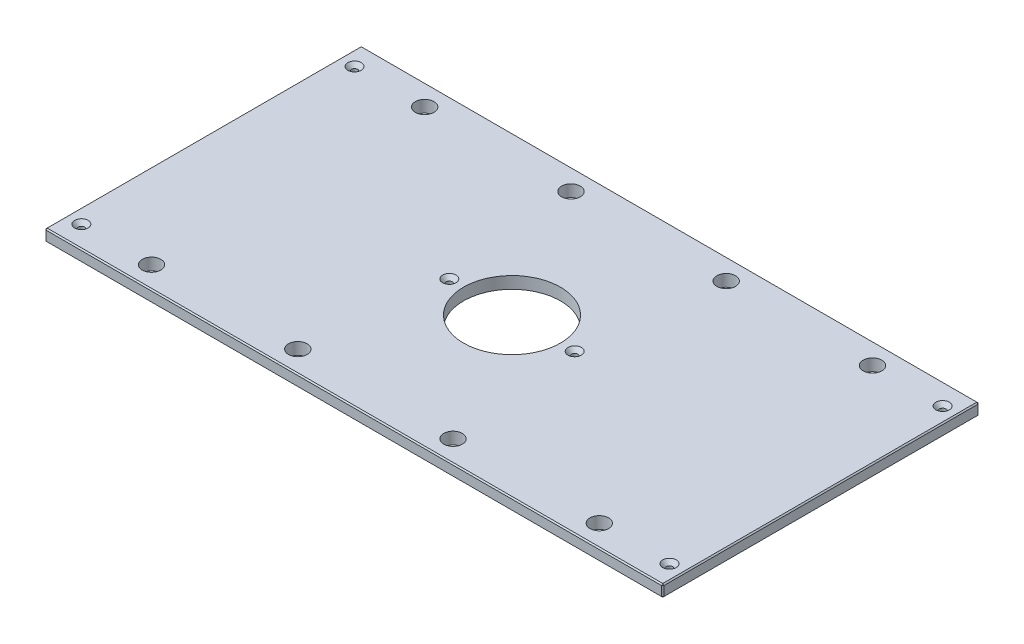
ISO-10303-21;
HEADER;
FILE_DESCRIPTION(('STEP AP214'),'2;1');
FILE_NAME('part.step','',(''),(''),'','','');
FILE_SCHEMA(('AUTOMOTIVE_DESIGN { 1 0 10303 214 1 1 1 1 }'));
ENDSEC;
DATA;
#1=APPLICATION_CONTEXT('core data for automotive mechanical design processes');
#2=APPLICATION_PROTOCOL_DEFINITION('international standard','automotive_design',2000,#1);
#3=PRODUCT_CONTEXT('',#1,'mechanical');
#4=PRODUCT('Part','Part','',(#3));
#5=PRODUCT_RELATED_PRODUCT_CATEGORY('part','',(#4));
#6=PRODUCT_DEFINITION_FORMATION('','',#4);
#7=PRODUCT_DEFINITION_CONTEXT('part definition',#1,'design');
#8=PRODUCT_DEFINITION('design','',#6,#7);
#9=PRODUCT_DEFINITION_SHAPE('','',#8);
#10=(LENGTH_UNIT() NAMED_UNIT(*) SI_UNIT(.MILLI.,.METRE.));
#11=(NAMED_UNIT(*) PLANE_ANGLE_UNIT() SI_UNIT($,.RADIAN.));
#12=(NAMED_UNIT(*) SI_UNIT($,.STERADIAN.) SOLID_ANGLE_UNIT());
#13=UNCERTAINTY_MEASURE_WITH_UNIT(LENGTH_MEASURE(1.E-05),#10,'distance_accuracy_value','');
#14=(GEOMETRIC_REPRESENTATION_CONTEXT(3) GLOBAL_UNCERTAINTY_ASSIGNED_CONTEXT((#13)) GLOBAL_UNIT_ASSIGNED_CONTEXT((#10,
#11,#12)) REPRESENTATION_CONTEXT('',''));
#15=CARTESIAN_POINT('',(0.,0.,0.));
#16=DIRECTION('',(0.,0.,1.));
#17=DIRECTION('',(1.,0.,0.));
#18=AXIS2_PLACEMENT_3D('',#15,#16,#17);
#19=CARTESIAN_POINT('',(-328.6125,12.7,-168.275));
#20=DIRECTION('',(1.,0.,0.));
#21=DIRECTION('',(0.,0.,-1.));
#22=AXIS2_PLACEMENT_3D('',#19,#20,#21);
#23=PLANE('',#22);
#24=DIRECTION('',(0.,0.,-1.));
#25=VECTOR('',#24,1.);
#26=CARTESIAN_POINT('',(-328.6125,11.43,-168.275));
#27=LINE('',#26,#25);
#28=CARTESIAN_POINT('',(-328.6125,11.43,167.005));
#29=VERTEX_POINT('',#28);
#30=CARTESIAN_POINT('',(-328.6125,11.43,-167.005));
#31=VERTEX_POINT('',#30);
#32=EDGE_CURVE('E135',#29,#31,#27,.T.);
#33=ORIENTED_EDGE('',*,*,#32,.T.);
#34=DIRECTION('',(0.,-1.,0.));
#35=VECTOR('',#34,1.);
#36=CARTESIAN_POINT('',(-328.6125,12.7,-167.005));
#37=LINE('',#36,#35);
#38=CARTESIAN_POINT('',(-328.6125,1.26999999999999,-167.005));
#39=VERTEX_POINT('',#38);
#40=EDGE_CURVE('E131',#31,#39,#37,.T.);
#41=ORIENTED_EDGE('',*,*,#40,.T.);
#42=DIRECTION('',(0.,0.,1.));
#43=VECTOR('',#42,1.);
#44=CARTESIAN_POINT('',(-328.6125,1.26999999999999,-168.275));
#45=LINE('',#44,#43);
#46=CARTESIAN_POINT('',(-328.6125,1.26999999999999,167.005));
#47=VERTEX_POINT('',#46);
#48=EDGE_CURVE('E126',#39,#47,#45,.T.);
#49=ORIENTED_EDGE('',*,*,#48,.T.);
#50=DIRECTION('',(0.,1.,0.));
#51=VECTOR('',#50,1.);
#52=CARTESIAN_POINT('',(-328.6125,12.7,167.005));
#53=LINE('',#52,#51);
#54=EDGE_CURVE('E128',#47,#29,#53,.T.);
#55=ORIENTED_EDGE('',*,*,#54,.T.);
#56=EDGE_LOOP('',(#33,#41,#49,#55));
#57=FACE_BOUND('',#56,.T.);
#58=ADVANCED_FACE('F35',(#57),#23,.F.);
#59=CARTESIAN_POINT('',(-328.6125,12.7,168.275));
#60=DIRECTION('',(0.,0.,-1.));
#61=DIRECTION('',(-1.,0.,0.));
#62=AXIS2_PLACEMENT_3D('',#59,#60,#61);
#63=PLANE('',#62);
#64=DIRECTION('',(1.,0.,0.));
#65=VECTOR('',#64,1.);
#66=CARTESIAN_POINT('',(-328.6125,1.26999999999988,168.275));
#67=LINE('',#66,#65);
#68=CARTESIAN_POINT('',(-327.3425,1.26999999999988,168.275));
#69=VERTEX_POINT('',#68);
#70=CARTESIAN_POINT('',(327.3425,1.26999999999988,168.275));
#71=VERTEX_POINT('',#70);
#72=EDGE_CURVE('E58',#69,#71,#67,.T.);
#73=ORIENTED_EDGE('',*,*,#72,.T.);
#74=DIRECTION('',(0.,1.,0.));
#75=VECTOR('',#74,1.);
#76=CARTESIAN_POINT('',(327.3425,12.7,168.275));
#77=LINE('',#76,#75);
#78=CARTESIAN_POINT('',(327.3425,11.4300000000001,168.275));
#79=VERTEX_POINT('',#78);
#80=EDGE_CURVE('E11',#71,#79,#77,.T.);
#81=ORIENTED_EDGE('',*,*,#80,.T.);
#82=DIRECTION('',(-1.,0.,0.));
#83=VECTOR('',#82,1.);
#84=CARTESIAN_POINT('',(-328.6125,11.4300000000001,168.275));
#85=LINE('',#84,#83);
#86=CARTESIAN_POINT('',(-327.3425,11.4300000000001,168.275));
#87=VERTEX_POINT('',#86);
#88=EDGE_CURVE('E44',#79,#87,#85,.T.);
#89=ORIENTED_EDGE('',*,*,#88,.T.);
#90=DIRECTION('',(0.,-1.,0.));
#91=VECTOR('',#90,1.);
#92=CARTESIAN_POINT('',(-327.3425,12.7,168.275));
#93=LINE('',#92,#91);
#94=EDGE_CURVE('E303',#87,#69,#93,.T.);
#95=ORIENTED_EDGE('',*,*,#94,.T.);
#96=EDGE_LOOP('',(#73,#81,#89,#95));
#97=FACE_BOUND('',#96,.T.);
#98=ADVANCED_FACE('F372',(#97),#63,.F.);
#99=CARTESIAN_POINT('',(328.6125,12.7,-168.275));
#100=DIRECTION('',(-1.,0.,0.));
#101=DIRECTION('',(0.,0.,1.));
#102=AXIS2_PLACEMENT_3D('',#99,#100,#101);
#103=PLANE('',#102);
#104=DIRECTION('',(0.,0.,-1.));
#105=VECTOR('',#104,1.);
#106=CARTESIAN_POINT('',(328.6125,1.26999999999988,-168.275));
#107=LINE('',#106,#105);
#108=CARTESIAN_POINT('',(328.6125,1.26999999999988,167.005));
#109=VERTEX_POINT('',#108);
#110=CARTESIAN_POINT('',(328.6125,1.26999999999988,-167.005));
#111=VERTEX_POINT('',#110);
#112=EDGE_CURVE('E298',#109,#111,#107,.T.);
#113=ORIENTED_EDGE('',*,*,#112,.T.);
#114=DIRECTION('',(0.,1.,0.));
#115=VECTOR('',#114,1.);
#116=CARTESIAN_POINT('',(328.6125,12.7,-167.005));
#117=LINE('',#116,#115);
#118=CARTESIAN_POINT('',(328.6125,11.43,-167.005));
#119=VERTEX_POINT('',#118);
#120=EDGE_CURVE('E300',#111,#119,#117,.T.);
#121=ORIENTED_EDGE('',*,*,#120,.T.);
#122=DIRECTION('',(0.,0.,1.));
#123=VECTOR('',#122,1.);
#124=CARTESIAN_POINT('',(328.6125,11.43,168.275));
#125=LINE('',#124,#123);
#126=CARTESIAN_POINT('',(328.6125,11.43,167.005));
#127=VERTEX_POINT('',#126);
#128=EDGE_CURVE('E296',#119,#127,#125,.T.);
#129=ORIENTED_EDGE('',*,*,#128,.T.);
#130=DIRECTION('',(0.,-1.,0.));
#131=VECTOR('',#130,1.);
#132=CARTESIAN_POINT('',(328.6125,12.7,167.005));
#133=LINE('',#132,#131);
#134=EDGE_CURVE('E294',#127,#109,#133,.T.);
#135=ORIENTED_EDGE('',*,*,#134,.T.);
#136=EDGE_LOOP('',(#113,#121,#129,#135));
#137=FACE_BOUND('',#136,.T.);
#138=ADVANCED_FACE('F359',(#137),#103,.F.);
#139=CARTESIAN_POINT('',(-328.6125,12.7,-168.275));
#140=DIRECTION('',(0.,0.,1.));
#141=DIRECTION('',(1.,0.,0.));
#142=AXIS2_PLACEMENT_3D('',#139,#140,#141);
#143=PLANE('',#142);
#144=DIRECTION('',(-1.,0.,0.));
#145=VECTOR('',#144,1.);
#146=CARTESIAN_POINT('',(-328.6125,1.26999999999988,-168.275));
#147=LINE('',#146,#145);
#148=CARTESIAN_POINT('',(327.3425,1.26999999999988,-168.275));
#149=VERTEX_POINT('',#148);
#150=CARTESIAN_POINT('',(-327.3425,1.26999999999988,-168.275));
#151=VERTEX_POINT('',#150);
#152=EDGE_CURVE('E270',#149,#151,#147,.T.);
#153=ORIENTED_EDGE('',*,*,#152,.T.);
#154=DIRECTION('',(0.,1.,0.));
#155=VECTOR('',#154,1.);
#156=CARTESIAN_POINT('',(-327.3425,12.7,-168.275));
#157=LINE('',#156,#155);
#158=CARTESIAN_POINT('',(-327.3425,11.43,-168.275));
#159=VERTEX_POINT('',#158);
#160=EDGE_CURVE('E274',#151,#159,#157,.T.);
#161=ORIENTED_EDGE('',*,*,#160,.T.);
#162=DIRECTION('',(1.,0.,0.));
#163=VECTOR('',#162,1.);
#164=CARTESIAN_POINT('',(328.6125,11.43,-168.275));
#165=LINE('',#164,#163);
#166=CARTESIAN_POINT('',(327.3425,11.43,-168.275));
#167=VERTEX_POINT('',#166);
#168=EDGE_CURVE('E272',#159,#167,#165,.T.);
#169=ORIENTED_EDGE('',*,*,#168,.T.);
#170=DIRECTION('',(0.,-1.,0.));
#171=VECTOR('',#170,1.);
#172=CARTESIAN_POINT('',(327.3425,12.7,-168.275));
#173=LINE('',#172,#171);
#174=EDGE_CURVE('E268',#167,#149,#173,.T.);
#175=ORIENTED_EDGE('',*,*,#174,.T.);
#176=EDGE_LOOP('',(#153,#161,#169,#175));
#177=FACE_BOUND('',#176,.T.);
#178=ADVANCED_FACE('F333',(#177),#143,.F.);
#179=CARTESIAN_POINT('',(0.,12.7,0.));
#180=DIRECTION('',(0.,1.,0.));
#181=DIRECTION('',(0.,0.,1.));
#182=AXIS2_PLACEMENT_3D('',#179,#180,#181);
#183=PLANE('',#182);
#184=CARTESIAN_POINT('',(312.7375,12.7,-145.25498));
#185=DIRECTION('',(0.,1.,0.));
#186=DIRECTION('',(0.,0.,1.));
#187=AXIS2_PLACEMENT_3D('',#184,#185,#186);
#188=CIRCLE('',#187,7.13740000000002);
#189=CARTESIAN_POINT('',(312.7375,12.7,-138.11758));
#190=VERTEX_POINT('',#189);
#191=EDGE_CURVE('E816',#190,#190,#188,.T.);
#192=ORIENTED_EDGE('',*,*,#191,.F.);
#193=EDGE_LOOP('',(#192));
#194=FACE_BOUND('',#193,.T.);
#195=CARTESIAN_POINT('',(312.7375,12.7,145.25498));
#196=DIRECTION('',(0.,1.,0.));
#197=DIRECTION('',(0.,0.,1.));
#198=AXIS2_PLACEMENT_3D('',#195,#196,#197);
#199=CIRCLE('',#198,7.13740000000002);
#200=CARTESIAN_POINT('',(312.7375,12.7,152.39238));
#201=VERTEX_POINT('',#200);
#202=EDGE_CURVE('E820',#201,#201,#199,.T.);
#203=ORIENTED_EDGE('',*,*,#202,.F.);
#204=EDGE_LOOP('',(#203));
#205=FACE_BOUND('',#204,.T.);
#206=CARTESIAN_POINT('',(-312.7375,12.7,145.25498));
#207=DIRECTION('',(0.,1.,0.));
#208=DIRECTION('',(0.,0.,1.));
#209=AXIS2_PLACEMENT_3D('',#206,#207,#208);
#210=CIRCLE('',#209,7.13740000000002);
#211=CARTESIAN_POINT('',(-312.7375,12.7,152.39238));
#212=VERTEX_POINT('',#211);
#213=EDGE_CURVE('E824',#212,#212,#210,.T.);
#214=ORIENTED_EDGE('',*,*,#213,.F.);
#215=EDGE_LOOP('',(#214));
#216=FACE_BOUND('',#215,.T.);
#217=CARTESIAN_POINT('',(-66.675,12.7,0.));
#218=DIRECTION('',(0.,1.,0.));
#219=DIRECTION('',(0.,0.,1.));
#220=AXIS2_PLACEMENT_3D('',#217,#218,#219);
#221=CIRCLE('',#220,7.1374);
#222=CARTESIAN_POINT('',(-66.675,12.7,7.1374));
#223=VERTEX_POINT('',#222);
#224=EDGE_CURVE('E828',#223,#223,#221,.T.);
#225=ORIENTED_EDGE('',*,*,#224,.F.);
#226=EDGE_LOOP('',(#225));
#227=FACE_BOUND('',#226,.T.);
#228=CARTESIAN_POINT('',(66.675,12.7,0.));
#229=DIRECTION('',(0.,1.,0.));
#230=DIRECTION('',(0.,0.,1.));
#231=AXIS2_PLACEMENT_3D('',#228,#229,#230);
#232=CIRCLE('',#231,7.1374);
#233=CARTESIAN_POINT('',(66.675,12.7,7.1374));
#234=VERTEX_POINT('',#233);
#235=EDGE_CURVE('E832',#234,#234,#232,.T.);
#236=ORIENTED_EDGE('',*,*,#235,.F.);
#237=EDGE_LOOP('',(#236));
#238=FACE_BOUND('',#237,.T.);
#239=CARTESIAN_POINT('',(-312.7375,12.7,-145.25498));
#240=DIRECTION('',(0.,1.,0.));
#241=DIRECTION('',(0.,0.,1.));
#242=AXIS2_PLACEMENT_3D('',#239,#240,#241);
#243=CIRCLE('',#242,7.13740000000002);
#244=CARTESIAN_POINT('',(-312.7375,12.7,-138.11758));
#245=VERTEX_POINT('',#244);
#246=EDGE_CURVE('E835',#245,#245,#243,.T.);
#247=ORIENTED_EDGE('',*,*,#246,.F.);
#248=EDGE_LOOP('',(#247));
#249=FACE_BOUND('',#248,.T.);
#250=DIRECTION('',(0.,0.,-1.));
#251=VECTOR('',#250,1.);
#252=CARTESIAN_POINT('',(327.3425,12.7,-168.275));
#253=LINE('',#252,#251);
#254=CARTESIAN_POINT('',(327.3425,12.7,167.005));
#255=VERTEX_POINT('',#254);
#256=CARTESIAN_POINT('',(327.3425,12.7,-167.005));
#257=VERTEX_POINT('',#256);
#258=EDGE_CURVE('E281',#255,#257,#253,.T.);
#259=ORIENTED_EDGE('',*,*,#258,.T.);
#260=DIRECTION('',(-1.,0.,0.));
#261=VECTOR('',#260,1.);
#262=CARTESIAN_POINT('',(-328.6125,12.7,-167.005));
#263=LINE('',#262,#261);
#264=CARTESIAN_POINT('',(-327.3425,12.7,-167.005));
#265=VERTEX_POINT('',#264);
#266=EDGE_CURVE('E283',#257,#265,#263,.T.);
#267=ORIENTED_EDGE('',*,*,#266,.T.);
#268=DIRECTION('',(0.,0.,1.));
#269=VECTOR('',#268,1.);
#270=CARTESIAN_POINT('',(-327.3425,12.7,168.275));
#271=LINE('',#270,#269);
#272=CARTESIAN_POINT('',(-327.3425,12.7,167.005));
#273=VERTEX_POINT('',#272);
#274=EDGE_CURVE('E279',#265,#273,#271,.T.);
#275=ORIENTED_EDGE('',*,*,#274,.T.);
#276=DIRECTION('',(1.,0.,0.));
#277=VECTOR('',#276,1.);
#278=CARTESIAN_POINT('',(328.6125,12.7,167.005));
#279=LINE('',#278,#277);
#280=EDGE_CURVE('E277',#273,#255,#279,.T.);
#281=ORIENTED_EDGE('',*,*,#280,.T.);
#282=EDGE_LOOP('',(#259,#267,#275,#281));
#283=FACE_BOUND('',#282,.T.);
#284=CARTESIAN_POINT('',(238.125,12.7,-145.25498));
#285=DIRECTION('',(0.,1.,0.));
#286=DIRECTION('',(0.,0.,1.));
#287=AXIS2_PLACEMENT_3D('',#284,#285,#286);
#288=CIRCLE('',#287,9.921875);
#289=CARTESIAN_POINT('',(238.125,12.7,-135.333105));
#290=VERTEX_POINT('',#289);
#291=EDGE_CURVE('E204',#290,#290,#288,.T.);
#292=ORIENTED_EDGE('',*,*,#291,.F.);
#293=EDGE_LOOP('',(#292));
#294=FACE_BOUND('',#293,.T.);
#295=CARTESIAN_POINT('',(-238.125,12.7,-145.25498));
#296=DIRECTION('',(0.,1.,0.));
#297=DIRECTION('',(0.,0.,1.));
#298=AXIS2_PLACEMENT_3D('',#295,#296,#297);
#299=CIRCLE('',#298,9.921875);
#300=CARTESIAN_POINT('',(-238.125,12.7,-135.333105));
#301=VERTEX_POINT('',#300);
#302=EDGE_CURVE('E214',#301,#301,#299,.T.);
#303=ORIENTED_EDGE('',*,*,#302,.F.);
#304=EDGE_LOOP('',(#303));
#305=FACE_BOUND('',#304,.T.);
#306=CARTESIAN_POINT('',(238.125,12.7,145.25498));
#307=DIRECTION('',(0.,1.,0.));
#308=DIRECTION('',(0.,0.,1.));
#309=AXIS2_PLACEMENT_3D('',#306,#307,#308);
#310=CIRCLE('',#309,9.921875);
#311=CARTESIAN_POINT('',(238.125,12.7,155.176855));
#312=VERTEX_POINT('',#311);
#313=EDGE_CURVE('E225',#312,#312,#310,.T.);
#314=ORIENTED_EDGE('',*,*,#313,.F.);
#315=EDGE_LOOP('',(#314));
#316=FACE_BOUND('',#315,.T.);
#317=CARTESIAN_POINT('',(-238.125,12.7,145.25498));
#318=DIRECTION('',(0.,1.,0.));
#319=DIRECTION('',(0.,0.,1.));
#320=AXIS2_PLACEMENT_3D('',#317,#318,#319);
#321=CIRCLE('',#320,9.921875);
#322=CARTESIAN_POINT('',(-238.125,12.7,155.176855));
#323=VERTEX_POINT('',#322);
#324=EDGE_CURVE('E231',#323,#323,#321,.T.);
#325=ORIENTED_EDGE('',*,*,#324,.F.);
#326=EDGE_LOOP('',(#325));
#327=FACE_BOUND('',#326,.T.);
#328=CARTESIAN_POINT('',(-82.55,12.7,-145.25498));
#329=DIRECTION('',(0.,1.,0.));
#330=DIRECTION('',(0.,0.,1.));
#331=AXIS2_PLACEMENT_3D('',#328,#329,#330);
#332=CIRCLE('',#331,9.921875);
#333=CARTESIAN_POINT('',(-82.55,12.7,-135.333105));
#334=VERTEX_POINT('',#333);
#335=EDGE_CURVE('E237',#334,#334,#332,.T.);
#336=ORIENTED_EDGE('',*,*,#335,.F.);
#337=EDGE_LOOP('',(#336));
#338=FACE_BOUND('',#337,.T.);
#339=CARTESIAN_POINT('',(82.55,12.7,-145.25498));
#340=DIRECTION('',(0.,1.,0.));
#341=DIRECTION('',(0.,0.,1.));
#342=AXIS2_PLACEMENT_3D('',#339,#340,#341);
#343=CIRCLE('',#342,9.921875);
#344=CARTESIAN_POINT('',(82.55,12.7,-135.333105));
#345=VERTEX_POINT('',#344);
#346=EDGE_CURVE('E243',#345,#345,#343,.T.);
#347=ORIENTED_EDGE('',*,*,#346,.F.);
#348=EDGE_LOOP('',(#347));
#349=FACE_BOUND('',#348,.T.);
#350=CARTESIAN_POINT('',(82.55,12.7,145.25498));
#351=DIRECTION('',(0.,1.,0.));
#352=DIRECTION('',(0.,0.,1.));
#353=AXIS2_PLACEMENT_3D('',#350,#351,#352);
#354=CIRCLE('',#353,9.921875);
#355=CARTESIAN_POINT('',(82.55,12.7,155.176855));
#356=VERTEX_POINT('',#355);
#357=EDGE_CURVE('E249',#356,#356,#354,.T.);
#358=ORIENTED_EDGE('',*,*,#357,.F.);
#359=EDGE_LOOP('',(#358));
#360=FACE_BOUND('',#359,.T.);
#361=CARTESIAN_POINT('',(-82.55,12.7,145.25498));
#362=DIRECTION('',(0.,1.,0.));
#363=DIRECTION('',(0.,0.,1.));
#364=AXIS2_PLACEMENT_3D('',#361,#362,#363);
#365=CIRCLE('',#364,9.921875);
#366=CARTESIAN_POINT('',(-82.55,12.7,155.176855));
#367=VERTEX_POINT('',#366);
#368=EDGE_CURVE('E255',#367,#367,#365,.T.);
#369=ORIENTED_EDGE('',*,*,#368,.F.);
#370=EDGE_LOOP('',(#369));
#371=FACE_BOUND('',#370,.T.);
#372=CARTESIAN_POINT('',(0.,12.7,0.));
#373=DIRECTION('',(0.,1.,0.));
#374=DIRECTION('',(0.,0.,1.));
#375=AXIS2_PLACEMENT_3D('',#372,#373,#374);
#376=CIRCLE('',#375,51.562);
#377=CARTESIAN_POINT('',(0.,12.7,51.562));
#378=VERTEX_POINT('',#377);
#379=EDGE_CURVE('E261',#378,#378,#376,.T.);
#380=ORIENTED_EDGE('',*,*,#379,.F.);
#381=EDGE_LOOP('',(#380));
#382=FACE_BOUND('',#381,.T.);
#383=ADVANCED_FACE('F381',(#194,#205,#216,#227,#238,#249,#283,#294,#305,#316,#327,#338,#349,
#360,#371,#382),#183,.T.);
#384=CARTESIAN_POINT('',(0.,0.,0.));
#385=DIRECTION('',(0.,1.,0.));
#386=DIRECTION('',(0.,0.,1.));
#387=AXIS2_PLACEMENT_3D('',#384,#385,#386);
#388=PLANE('',#387);
#389=CARTESIAN_POINT('',(312.7375,0.,-145.25498));
#390=DIRECTION('',(0.,1.,0.));
#391=DIRECTION('',(0.,0.,1.));
#392=AXIS2_PLACEMENT_3D('',#389,#390,#391);
#393=CIRCLE('',#392,3.3782);
#394=CARTESIAN_POINT('',(312.7375,0.,-141.87678));
#395=VERTEX_POINT('',#394);
#396=EDGE_CURVE('E869',#395,#395,#393,.T.);
#397=ORIENTED_EDGE('',*,*,#396,.T.);
#398=EDGE_LOOP('',(#397));
#399=FACE_BOUND('',#398,.T.);
#400=CARTESIAN_POINT('',(312.7375,0.,145.25498));
#401=DIRECTION('',(0.,1.,0.));
#402=DIRECTION('',(0.,0.,1.));
#403=AXIS2_PLACEMENT_3D('',#400,#401,#402);
#404=CIRCLE('',#403,3.3782);
#405=CARTESIAN_POINT('',(312.7375,0.,148.63318));
#406=VERTEX_POINT('',#405);
#407=EDGE_CURVE('E862',#406,#406,#404,.T.);
#408=ORIENTED_EDGE('',*,*,#407,.T.);
#409=EDGE_LOOP('',(#408));
#410=FACE_BOUND('',#409,.T.);
#411=CARTESIAN_POINT('',(-312.7375,0.,145.25498));
#412=DIRECTION('',(0.,1.,0.));
#413=DIRECTION('',(0.,0.,1.));
#414=AXIS2_PLACEMENT_3D('',#411,#412,#413);
#415=CIRCLE('',#414,3.3782);
#416=CARTESIAN_POINT('',(-312.7375,0.,148.63318));
#417=VERTEX_POINT('',#416);
#418=EDGE_CURVE('E855',#417,#417,#415,.T.);
#419=ORIENTED_EDGE('',*,*,#418,.T.);
#420=EDGE_LOOP('',(#419));
#421=FACE_BOUND('',#420,.T.);
#422=CARTESIAN_POINT('',(-66.675,0.,0.));
#423=DIRECTION('',(0.,1.,0.));
#424=DIRECTION('',(0.,0.,1.));
#425=AXIS2_PLACEMENT_3D('',#422,#423,#424);
#426=CIRCLE('',#425,3.3782);
#427=CARTESIAN_POINT('',(-66.675,0.,3.3782));
#428=VERTEX_POINT('',#427);
#429=EDGE_CURVE('E848',#428,#428,#426,.T.);
#430=ORIENTED_EDGE('',*,*,#429,.T.);
#431=EDGE_LOOP('',(#430));
#432=FACE_BOUND('',#431,.T.);
#433=CARTESIAN_POINT('',(66.675,0.,0.));
#434=DIRECTION('',(0.,1.,0.));
#435=DIRECTION('',(0.,0.,1.));
#436=AXIS2_PLACEMENT_3D('',#433,#434,#435);
#437=CIRCLE('',#436,3.3782);
#438=CARTESIAN_POINT('',(66.675,0.,3.3782));
#439=VERTEX_POINT('',#438);
#440=EDGE_CURVE('E838',#439,#439,#437,.T.);
#441=ORIENTED_EDGE('',*,*,#440,.T.);
#442=EDGE_LOOP('',(#441));
#443=FACE_BOUND('',#442,.T.);
#444=CARTESIAN_POINT('',(-312.7375,0.,-145.25498));
#445=DIRECTION('',(0.,1.,0.));
#446=DIRECTION('',(0.,0.,1.));
#447=AXIS2_PLACEMENT_3D('',#444,#445,#446);
#448=CIRCLE('',#447,3.3782);
#449=CARTESIAN_POINT('',(-312.7375,0.,-141.87678));
#450=VERTEX_POINT('',#449);
#451=EDGE_CURVE('E217',#450,#450,#448,.T.);
#452=ORIENTED_EDGE('',*,*,#451,.T.);
#453=EDGE_LOOP('',(#452));
#454=FACE_BOUND('',#453,.T.);
#455=DIRECTION('',(0.,0.,-1.));
#456=VECTOR('',#455,1.);
#457=CARTESIAN_POINT('',(-327.3425,0.,0.));
#458=LINE('',#457,#456);
#459=CARTESIAN_POINT('',(-327.3425,0.,167.005));
#460=VERTEX_POINT('',#459);
#461=CARTESIAN_POINT('',(-327.3425,0.,-167.005));
#462=VERTEX_POINT('',#461);
#463=EDGE_CURVE('E158',#460,#462,#458,.T.);
#464=ORIENTED_EDGE('',*,*,#463,.T.);
#465=DIRECTION('',(1.,0.,0.));
#466=VECTOR('',#465,1.);
#467=CARTESIAN_POINT('',(0.,0.,-167.005));
#468=LINE('',#467,#466);
#469=CARTESIAN_POINT('',(327.3425,0.,-167.005));
#470=VERTEX_POINT('',#469);
#471=EDGE_CURVE('E291',#462,#470,#468,.T.);
#472=ORIENTED_EDGE('',*,*,#471,.T.);
#473=DIRECTION('',(0.,0.,1.));
#474=VECTOR('',#473,1.);
#475=CARTESIAN_POINT('',(327.3425,0.,0.));
#476=LINE('',#475,#474);
#477=CARTESIAN_POINT('',(327.3425,0.,167.005));
#478=VERTEX_POINT('',#477);
#479=EDGE_CURVE('E289',#470,#478,#476,.T.);
#480=ORIENTED_EDGE('',*,*,#479,.T.);
#481=DIRECTION('',(-1.,0.,0.));
#482=VECTOR('',#481,1.);
#483=CARTESIAN_POINT('',(0.,0.,167.005));
#484=LINE('',#483,#482);
#485=EDGE_CURVE('E286',#478,#460,#484,.T.);
#486=ORIENTED_EDGE('',*,*,#485,.T.);
#487=EDGE_LOOP('',(#464,#472,#480,#486));
#488=FACE_BOUND('',#487,.T.);
#489=CARTESIAN_POINT('',(238.125,0.,-145.25498));
#490=DIRECTION('',(0.,1.,0.));
#491=DIRECTION('',(0.,0.,1.));
#492=AXIS2_PLACEMENT_3D('',#489,#490,#491);
#493=CIRCLE('',#492,9.921875);
#494=CARTESIAN_POINT('',(238.125,0.,-135.333105));
#495=VERTEX_POINT('',#494);
#496=EDGE_CURVE('E209',#495,#495,#493,.T.);
#497=ORIENTED_EDGE('',*,*,#496,.T.);
#498=EDGE_LOOP('',(#497));
#499=FACE_BOUND('',#498,.T.);
#500=CARTESIAN_POINT('',(-238.125,0.,-145.25498));
#501=DIRECTION('',(0.,1.,0.));
#502=DIRECTION('',(0.,0.,1.));
#503=AXIS2_PLACEMENT_3D('',#500,#501,#502);
#504=CIRCLE('',#503,9.921875);
#505=CARTESIAN_POINT('',(-238.125,0.,-135.333105));
#506=VERTEX_POINT('',#505);
#507=EDGE_CURVE('E222',#506,#506,#504,.T.);
#508=ORIENTED_EDGE('',*,*,#507,.T.);
#509=EDGE_LOOP('',(#508));
#510=FACE_BOUND('',#509,.T.);
#511=CARTESIAN_POINT('',(238.125,0.,145.25498));
#512=DIRECTION('',(0.,1.,0.));
#513=DIRECTION('',(0.,0.,1.));
#514=AXIS2_PLACEMENT_3D('',#511,#512,#513);
#515=CIRCLE('',#514,9.921875);
#516=CARTESIAN_POINT('',(238.125,0.,155.176855));
#517=VERTEX_POINT('',#516);
#518=EDGE_CURVE('E228',#517,#517,#515,.T.);
#519=ORIENTED_EDGE('',*,*,#518,.T.);
#520=EDGE_LOOP('',(#519));
#521=FACE_BOUND('',#520,.T.);
#522=CARTESIAN_POINT('',(-238.125,0.,145.25498));
#523=DIRECTION('',(0.,1.,0.));
#524=DIRECTION('',(0.,0.,1.));
#525=AXIS2_PLACEMENT_3D('',#522,#523,#524);
#526=CIRCLE('',#525,9.921875);
#527=CARTESIAN_POINT('',(-238.125,0.,155.176855));
#528=VERTEX_POINT('',#527);
#529=EDGE_CURVE('E234',#528,#528,#526,.T.);
#530=ORIENTED_EDGE('',*,*,#529,.T.);
#531=EDGE_LOOP('',(#530));
#532=FACE_BOUND('',#531,.T.);
#533=CARTESIAN_POINT('',(-82.55,0.,-145.25498));
#534=DIRECTION('',(0.,1.,0.));
#535=DIRECTION('',(0.,0.,1.));
#536=AXIS2_PLACEMENT_3D('',#533,#534,#535);
#537=CIRCLE('',#536,9.921875);
#538=CARTESIAN_POINT('',(-82.55,0.,-135.333105));
#539=VERTEX_POINT('',#538);
#540=EDGE_CURVE('E240',#539,#539,#537,.T.);
#541=ORIENTED_EDGE('',*,*,#540,.T.);
#542=EDGE_LOOP('',(#541));
#543=FACE_BOUND('',#542,.T.);
#544=CARTESIAN_POINT('',(82.55,0.,-145.25498));
#545=DIRECTION('',(0.,1.,0.));
#546=DIRECTION('',(0.,0.,1.));
#547=AXIS2_PLACEMENT_3D('',#544,#545,#546);
#548=CIRCLE('',#547,9.921875);
#549=CARTESIAN_POINT('',(82.55,0.,-135.333105));
#550=VERTEX_POINT('',#549);
#551=EDGE_CURVE('E246',#550,#550,#548,.T.);
#552=ORIENTED_EDGE('',*,*,#551,.T.);
#553=EDGE_LOOP('',(#552));
#554=FACE_BOUND('',#553,.T.);
#555=CARTESIAN_POINT('',(82.55,0.,145.25498));
#556=DIRECTION('',(0.,1.,0.));
#557=DIRECTION('',(0.,0.,1.));
#558=AXIS2_PLACEMENT_3D('',#555,#556,#557);
#559=CIRCLE('',#558,9.921875);
#560=CARTESIAN_POINT('',(82.55,0.,155.176855));
#561=VERTEX_POINT('',#560);
#562=EDGE_CURVE('E252',#561,#561,#559,.T.);
#563=ORIENTED_EDGE('',*,*,#562,.T.);
#564=EDGE_LOOP('',(#563));
#565=FACE_BOUND('',#564,.T.);
#566=CARTESIAN_POINT('',(-82.55,0.,145.25498));
#567=DIRECTION('',(0.,1.,0.));
#568=DIRECTION('',(0.,0.,1.));
#569=AXIS2_PLACEMENT_3D('',#566,#567,#568);
#570=CIRCLE('',#569,9.921875);
#571=CARTESIAN_POINT('',(-82.55,0.,155.176855));
#572=VERTEX_POINT('',#571);
#573=EDGE_CURVE('E258',#572,#572,#570,.T.);
#574=ORIENTED_EDGE('',*,*,#573,.T.);
#575=EDGE_LOOP('',(#574));
#576=FACE_BOUND('',#575,.T.);
#577=CARTESIAN_POINT('',(0.,0.,0.));
#578=DIRECTION('',(0.,1.,0.));
#579=DIRECTION('',(0.,0.,1.));
#580=AXIS2_PLACEMENT_3D('',#577,#578,#579);
#581=CIRCLE('',#580,51.562);
#582=CARTESIAN_POINT('',(0.,0.,51.562));
#583=VERTEX_POINT('',#582);
#584=EDGE_CURVE('E147',#583,#583,#581,.T.);
#585=ORIENTED_EDGE('',*,*,#584,.T.);
#586=EDGE_LOOP('',(#585));
#587=FACE_BOUND('',#586,.T.);
#588=ADVANCED_FACE('F346',(#399,#410,#421,#432,#443,#454,#488,#499,#510,#521,#532,#543,#554,
#565,#576,#587),#388,.F.);
#589=CARTESIAN_POINT('',(0.,0.,0.));
#590=DIRECTION('',(0.,1.,0.));
#591=DIRECTION('',(0.,0.,1.));
#592=AXIS2_PLACEMENT_3D('',#589,#590,#591);
#593=CYLINDRICAL_SURFACE('',#592,51.562);
#594=ORIENTED_EDGE('',*,*,#584,.F.);
#595=EDGE_LOOP('',(#594));
#596=FACE_BOUND('',#595,.T.);
#597=ORIENTED_EDGE('',*,*,#379,.T.);
#598=EDGE_LOOP('',(#597));
#599=FACE_BOUND('',#598,.T.);
#600=ADVANCED_FACE('F751',(#596,#599),#593,.F.);
#601=CARTESIAN_POINT('',(-82.55,12.7,145.25498));
#602=DIRECTION('',(0.,1.,0.));
#603=DIRECTION('',(0.,0.,1.));
#604=AXIS2_PLACEMENT_3D('',#601,#602,#603);
#605=CYLINDRICAL_SURFACE('',#604,9.921875);
#606=ORIENTED_EDGE('',*,*,#573,.F.);
#607=EDGE_LOOP('',(#606));
#608=FACE_BOUND('',#607,.T.);
#609=ORIENTED_EDGE('',*,*,#368,.T.);
#610=EDGE_LOOP('',(#609));
#611=FACE_BOUND('',#610,.T.);
#612=ADVANCED_FACE('F742',(#608,#611),#605,.F.);
#613=CARTESIAN_POINT('',(82.55,12.7,145.25498));
#614=DIRECTION('',(0.,1.,0.));
#615=DIRECTION('',(0.,0.,1.));
#616=AXIS2_PLACEMENT_3D('',#613,#614,#615);
#617=CYLINDRICAL_SURFACE('',#616,9.921875);
#618=ORIENTED_EDGE('',*,*,#562,.F.);
#619=EDGE_LOOP('',(#618));
#620=FACE_BOUND('',#619,.T.);
#621=ORIENTED_EDGE('',*,*,#357,.T.);
#622=EDGE_LOOP('',(#621));
#623=FACE_BOUND('',#622,.T.);
#624=ADVANCED_FACE('F733',(#620,#623),#617,.F.);
#625=CARTESIAN_POINT('',(82.55,12.7,-145.25498));
#626=DIRECTION('',(0.,1.,0.));
#627=DIRECTION('',(0.,0.,1.));
#628=AXIS2_PLACEMENT_3D('',#625,#626,#627);
#629=CYLINDRICAL_SURFACE('',#628,9.921875);
#630=ORIENTED_EDGE('',*,*,#551,.F.);
#631=EDGE_LOOP('',(#630));
#632=FACE_BOUND('',#631,.T.);
#633=ORIENTED_EDGE('',*,*,#346,.T.);
#634=EDGE_LOOP('',(#633));
#635=FACE_BOUND('',#634,.T.);
#636=ADVANCED_FACE('F724',(#632,#635),#629,.F.);
#637=CARTESIAN_POINT('',(-82.55,12.7,-145.25498));
#638=DIRECTION('',(0.,1.,0.));
#639=DIRECTION('',(0.,0.,1.));
#640=AXIS2_PLACEMENT_3D('',#637,#638,#639);
#641=CYLINDRICAL_SURFACE('',#640,9.921875);
#642=ORIENTED_EDGE('',*,*,#540,.F.);
#643=EDGE_LOOP('',(#642));
#644=FACE_BOUND('',#643,.T.);
#645=ORIENTED_EDGE('',*,*,#335,.T.);
#646=EDGE_LOOP('',(#645));
#647=FACE_BOUND('',#646,.T.);
#648=ADVANCED_FACE('F715',(#644,#647),#641,.F.);
#649=CARTESIAN_POINT('',(-238.125,12.7,145.25498));
#650=DIRECTION('',(0.,1.,0.));
#651=DIRECTION('',(0.,0.,1.));
#652=AXIS2_PLACEMENT_3D('',#649,#650,#651);
#653=CYLINDRICAL_SURFACE('',#652,9.921875);
#654=ORIENTED_EDGE('',*,*,#529,.F.);
#655=EDGE_LOOP('',(#654));
#656=FACE_BOUND('',#655,.T.);
#657=ORIENTED_EDGE('',*,*,#324,.T.);
#658=EDGE_LOOP('',(#657));
#659=FACE_BOUND('',#658,.T.);
#660=ADVANCED_FACE('F706',(#656,#659),#653,.F.);
#661=CARTESIAN_POINT('',(238.125,12.7,145.25498));
#662=DIRECTION('',(0.,1.,0.));
#663=DIRECTION('',(0.,0.,1.));
#664=AXIS2_PLACEMENT_3D('',#661,#662,#663);
#665=CYLINDRICAL_SURFACE('',#664,9.921875);
#666=ORIENTED_EDGE('',*,*,#518,.F.);
#667=EDGE_LOOP('',(#666));
#668=FACE_BOUND('',#667,.T.);
#669=ORIENTED_EDGE('',*,*,#313,.T.);
#670=EDGE_LOOP('',(#669));
#671=FACE_BOUND('',#670,.T.);
#672=ADVANCED_FACE('F697',(#668,#671),#665,.F.);
#673=CARTESIAN_POINT('',(-238.125,12.7,-145.25498));
#674=DIRECTION('',(0.,1.,0.));
#675=DIRECTION('',(0.,0.,1.));
#676=AXIS2_PLACEMENT_3D('',#673,#674,#675);
#677=CYLINDRICAL_SURFACE('',#676,9.921875);
#678=ORIENTED_EDGE('',*,*,#507,.F.);
#679=EDGE_LOOP('',(#678));
#680=FACE_BOUND('',#679,.T.);
#681=ORIENTED_EDGE('',*,*,#302,.T.);
#682=EDGE_LOOP('',(#681));
#683=FACE_BOUND('',#682,.T.);
#684=ADVANCED_FACE('F687',(#680,#683),#677,.F.);
#685=CARTESIAN_POINT('',(238.125,12.7,-145.25498));
#686=DIRECTION('',(0.,1.,0.));
#687=DIRECTION('',(0.,0.,1.));
#688=AXIS2_PLACEMENT_3D('',#685,#686,#687);
#689=CYLINDRICAL_SURFACE('',#688,9.921875);
#690=ORIENTED_EDGE('',*,*,#496,.F.);
#691=EDGE_LOOP('',(#690));
#692=FACE_BOUND('',#691,.T.);
#693=ORIENTED_EDGE('',*,*,#291,.T.);
#694=EDGE_LOOP('',(#693));
#695=FACE_BOUND('',#694,.T.);
#696=ADVANCED_FACE('F390',(#692,#695),#689,.F.);
#697=CARTESIAN_POINT('',(328.6125,12.7,167.005));
#698=DIRECTION('',(-0.707106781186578,0.,-0.707106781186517));
#699=DIRECTION('',(0.,-1.,0.));
#700=AXIS2_PLACEMENT_3D('',#697,#698,#699);
#701=PLANE('',#700);
#702=DIRECTION('',(-0.707106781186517,0.,0.707106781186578));
#703=VECTOR('',#702,1.);
#704=CARTESIAN_POINT('',(328.6125,11.43,167.005));
#705=LINE('',#704,#703);
#706=EDGE_CURVE('E39',#79,#127,#705,.F.);
#707=ORIENTED_EDGE('',*,*,#706,.F.);
#708=ORIENTED_EDGE('',*,*,#80,.F.);
#709=DIRECTION('',(0.707106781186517,0.,-0.707106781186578));
#710=VECTOR('',#709,1.);
#711=CARTESIAN_POINT('',(327.9775,1.26999999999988,167.64));
#712=LINE('',#711,#710);
#713=EDGE_CURVE('E197',#109,#71,#712,.F.);
#714=ORIENTED_EDGE('',*,*,#713,.F.);
#715=ORIENTED_EDGE('',*,*,#134,.F.);
#716=EDGE_LOOP('',(#707,#708,#714,#715));
#717=FACE_BOUND('',#716,.T.);
#718=ADVANCED_FACE('F37',(#717),#701,.F.);
#719=CARTESIAN_POINT('',(328.6125,11.43,167.005));
#720=DIRECTION('',(0.577350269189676,0.577350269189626,0.577350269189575));
#721=DIRECTION('',(-0.707106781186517,0.707106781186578,0.));
#722=AXIS2_PLACEMENT_3D('',#719,#720,#721);
#723=PLANE('',#722);
#724=DIRECTION('',(0.,-0.707106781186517,0.707106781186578));
#725=VECTOR('',#724,1.);
#726=CARTESIAN_POINT('',(327.3425,12.0650000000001,167.64));
#727=LINE('',#726,#725);
#728=EDGE_CURVE('E193',#79,#255,#727,.F.);
#729=ORIENTED_EDGE('',*,*,#728,.F.);
#730=ORIENTED_EDGE('',*,*,#706,.T.);
#731=DIRECTION('',(-0.707106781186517,0.707106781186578,0.));
#732=VECTOR('',#731,1.);
#733=CARTESIAN_POINT('',(328.6125,11.43,167.005));
#734=LINE('',#733,#732);
#735=EDGE_CURVE('E195',#255,#127,#734,.F.);
#736=ORIENTED_EDGE('',*,*,#735,.F.);
#737=EDGE_LOOP('',(#729,#730,#736));
#738=FACE_BOUND('',#737,.T.);
#739=ADVANCED_FACE('F383',(#738),#723,.T.);
#740=CARTESIAN_POINT('',(327.3425,0.,167.005));
#741=DIRECTION('',(0.577350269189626,-0.577350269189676,0.577350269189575));
#742=DIRECTION('',(0.707106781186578,0.707106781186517,0.));
#743=AXIS2_PLACEMENT_3D('',#740,#741,#742);
#744=PLANE('',#743);
#745=DIRECTION('',(-0.707106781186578,-0.707106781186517,0.));
#746=VECTOR('',#745,1.);
#747=CARTESIAN_POINT('',(327.3425,0.,167.005));
#748=LINE('',#747,#746);
#749=EDGE_CURVE('E187',#109,#478,#748,.T.);
#750=ORIENTED_EDGE('',*,*,#749,.F.);
#751=ORIENTED_EDGE('',*,*,#713,.T.);
#752=DIRECTION('',(0.,0.707106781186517,0.707106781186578));
#753=VECTOR('',#752,1.);
#754=CARTESIAN_POINT('',(327.3425,0.,167.005));
#755=LINE('',#754,#753);
#756=EDGE_CURVE('E190',#478,#71,#755,.T.);
#757=ORIENTED_EDGE('',*,*,#756,.F.);
#758=EDGE_LOOP('',(#750,#751,#757));
#759=FACE_BOUND('',#758,.T.);
#760=ADVANCED_FACE('F352',(#759),#744,.T.);
#761=CARTESIAN_POINT('',(327.3425,12.7,0.));
#762=DIRECTION('',(0.707106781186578,0.707106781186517,0.));
#763=DIRECTION('',(0.,0.,1.));
#764=AXIS2_PLACEMENT_3D('',#761,#762,#763);
#765=PLANE('',#764);
#766=ORIENTED_EDGE('',*,*,#735,.T.);
#767=ORIENTED_EDGE('',*,*,#128,.F.);
#768=DIRECTION('',(0.707106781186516,-0.707106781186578,0.));
#769=VECTOR('',#768,1.);
#770=CARTESIAN_POINT('',(327.9775,12.065,-167.005));
#771=LINE('',#770,#769);
#772=EDGE_CURVE('E182',#257,#119,#771,.T.);
#773=ORIENTED_EDGE('',*,*,#772,.F.);
#774=ORIENTED_EDGE('',*,*,#258,.F.);
#775=EDGE_LOOP('',(#766,#767,#773,#774));
#776=FACE_BOUND('',#775,.T.);
#777=ADVANCED_FACE('F369',(#776),#765,.T.);
#778=CARTESIAN_POINT('',(0.,12.7,167.005));
#779=DIRECTION('',(0.,0.707106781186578,0.707106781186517));
#780=DIRECTION('',(-1.,0.,0.));
#781=AXIS2_PLACEMENT_3D('',#778,#779,#780);
#782=PLANE('',#781);
#783=ORIENTED_EDGE('',*,*,#728,.T.);
#784=ORIENTED_EDGE('',*,*,#280,.F.);
#785=DIRECTION('',(0.,0.707106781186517,-0.707106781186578));
#786=VECTOR('',#785,1.);
#787=CARTESIAN_POINT('',(-327.3425,12.7,167.005));
#788=LINE('',#787,#786);
#789=EDGE_CURVE('E179',#87,#273,#788,.T.);
#790=ORIENTED_EDGE('',*,*,#789,.F.);
#791=ORIENTED_EDGE('',*,*,#88,.F.);
#792=EDGE_LOOP('',(#783,#784,#790,#791));
#793=FACE_BOUND('',#792,.T.);
#794=ADVANCED_FACE('F374',(#793),#782,.T.);
#795=CARTESIAN_POINT('',(-327.3425,12.7,168.275));
#796=DIRECTION('',(0.707106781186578,0.,-0.707106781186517));
#797=DIRECTION('',(0.,-1.,0.));
#798=AXIS2_PLACEMENT_3D('',#795,#796,#797);
#799=PLANE('',#798);
#800=DIRECTION('',(0.707106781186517,0.,0.707106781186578));
#801=VECTOR('',#800,1.);
#802=CARTESIAN_POINT('',(-328.6125,1.26999999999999,167.005));
#803=LINE('',#802,#801);
#804=EDGE_CURVE('E142',#69,#47,#803,.F.);
#805=ORIENTED_EDGE('',*,*,#804,.F.);
#806=ORIENTED_EDGE('',*,*,#94,.F.);
#807=DIRECTION('',(-0.707106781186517,0.,-0.707106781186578));
#808=VECTOR('',#807,1.);
#809=CARTESIAN_POINT('',(-327.9775,11.4300000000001,167.64));
#810=LINE('',#809,#808);
#811=EDGE_CURVE('E145',#29,#87,#810,.F.);
#812=ORIENTED_EDGE('',*,*,#811,.F.);
#813=ORIENTED_EDGE('',*,*,#54,.F.);
#814=EDGE_LOOP('',(#805,#806,#812,#813));
#815=FACE_BOUND('',#814,.T.);
#816=ADVANCED_FACE('F140',(#815),#799,.F.);
#817=CARTESIAN_POINT('',(-328.6125,1.26999999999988,168.275));
#818=DIRECTION('',(0.,0.707106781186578,-0.707106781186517));
#819=DIRECTION('',(1.,0.,0.));
#820=AXIS2_PLACEMENT_3D('',#817,#818,#819);
#821=PLANE('',#820);
#822=ORIENTED_EDGE('',*,*,#756,.T.);
#823=ORIENTED_EDGE('',*,*,#72,.F.);
#824=DIRECTION('',(0.,-0.707106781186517,-0.707106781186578));
#825=VECTOR('',#824,1.);
#826=CARTESIAN_POINT('',(-327.3425,0.634999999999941,167.64));
#827=LINE('',#826,#825);
#828=EDGE_CURVE('E155',#460,#69,#827,.F.);
#829=ORIENTED_EDGE('',*,*,#828,.F.);
#830=ORIENTED_EDGE('',*,*,#485,.F.);
#831=EDGE_LOOP('',(#822,#823,#829,#830));
#832=FACE_BOUND('',#831,.T.);
#833=ADVANCED_FACE('F351',(#832),#821,.F.);
#834=CARTESIAN_POINT('',(328.6125,1.26999999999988,-168.275));
#835=DIRECTION('',(-0.707106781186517,0.707106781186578,0.));
#836=DIRECTION('',(0.,0.,-1.));
#837=AXIS2_PLACEMENT_3D('',#834,#835,#836);
#838=PLANE('',#837);
#839=ORIENTED_EDGE('',*,*,#749,.T.);
#840=ORIENTED_EDGE('',*,*,#479,.F.);
#841=DIRECTION('',(0.707106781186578,0.707106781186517,0.));
#842=VECTOR('',#841,1.);
#843=CARTESIAN_POINT('',(327.3425,0.,-167.005));
#844=LINE('',#843,#842);
#845=EDGE_CURVE('E174',#111,#470,#844,.F.);
#846=ORIENTED_EDGE('',*,*,#845,.F.);
#847=ORIENTED_EDGE('',*,*,#112,.F.);
#848=EDGE_LOOP('',(#839,#840,#846,#847));
#849=FACE_BOUND('',#848,.T.);
#850=ADVANCED_FACE('F356',(#849),#838,.F.);
#851=CARTESIAN_POINT('',(327.3425,12.7,-168.275));
#852=DIRECTION('',(-0.707106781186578,0.,0.707106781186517));
#853=DIRECTION('',(0.,-1.,0.));
#854=AXIS2_PLACEMENT_3D('',#851,#852,#853);
#855=PLANE('',#854);
#856=DIRECTION('',(0.707106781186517,0.,0.707106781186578));
#857=VECTOR('',#856,1.);
#858=CARTESIAN_POINT('',(327.3425,11.43,-168.275));
#859=LINE('',#858,#857);
#860=EDGE_CURVE('E184',#119,#167,#859,.F.);
#861=ORIENTED_EDGE('',*,*,#860,.F.);
#862=ORIENTED_EDGE('',*,*,#120,.F.);
#863=DIRECTION('',(-0.707106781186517,0.,-0.707106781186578));
#864=VECTOR('',#863,1.);
#865=CARTESIAN_POINT('',(327.9775,1.26999999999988,-167.64));
#866=LINE('',#865,#864);
#867=EDGE_CURVE('E171',#149,#111,#866,.F.);
#868=ORIENTED_EDGE('',*,*,#867,.F.);
#869=ORIENTED_EDGE('',*,*,#174,.F.);
#870=EDGE_LOOP('',(#861,#862,#868,#869));
#871=FACE_BOUND('',#870,.T.);
#872=ADVANCED_FACE('F364',(#871),#855,.F.);
#873=CARTESIAN_POINT('',(327.3425,11.43,-168.275));
#874=DIRECTION('',(0.577350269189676,0.577350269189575,-0.577350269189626));
#875=DIRECTION('',(-0.707106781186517,0.,-0.707106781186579));
#876=AXIS2_PLACEMENT_3D('',#873,#874,#875);
#877=PLANE('',#876);
#878=ORIENTED_EDGE('',*,*,#772,.T.);
#879=ORIENTED_EDGE('',*,*,#860,.T.);
#880=DIRECTION('',(0.,0.707106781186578,0.707106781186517));
#881=VECTOR('',#880,1.);
#882=CARTESIAN_POINT('',(327.3425,11.43,-168.275));
#883=LINE('',#882,#881);
#884=EDGE_CURVE('E163',#257,#167,#883,.F.);
#885=ORIENTED_EDGE('',*,*,#884,.F.);
#886=EDGE_LOOP('',(#878,#879,#885));
#887=FACE_BOUND('',#886,.T.);
#888=ADVANCED_FACE('F422',(#887),#877,.T.);
#889=CARTESIAN_POINT('',(-327.3425,12.7,167.005));
#890=DIRECTION('',(-0.577350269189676,0.577350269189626,0.577350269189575));
#891=DIRECTION('',(-0.707106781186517,-0.707106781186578,0.));
#892=AXIS2_PLACEMENT_3D('',#889,#890,#891);
#893=PLANE('',#892);
#894=ORIENTED_EDGE('',*,*,#811,.T.);
#895=ORIENTED_EDGE('',*,*,#789,.T.);
#896=DIRECTION('',(-0.707106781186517,-0.707106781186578,0.));
#897=VECTOR('',#896,1.);
#898=CARTESIAN_POINT('',(-327.3425,12.7,167.005));
#899=LINE('',#898,#897);
#900=EDGE_CURVE('E159',#29,#273,#899,.F.);
#901=ORIENTED_EDGE('',*,*,#900,.F.);
#902=EDGE_LOOP('',(#894,#895,#901));
#903=FACE_BOUND('',#902,.T.);
#904=ADVANCED_FACE('F376',(#903),#893,.T.);
#905=CARTESIAN_POINT('',(-328.6125,1.26999999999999,167.005));
#906=DIRECTION('',(-0.577350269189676,-0.577350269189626,0.577350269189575));
#907=DIRECTION('',(0.707106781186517,-0.707106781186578,0.));
#908=AXIS2_PLACEMENT_3D('',#905,#906,#907);
#909=PLANE('',#908);
#910=ORIENTED_EDGE('',*,*,#828,.T.);
#911=ORIENTED_EDGE('',*,*,#804,.T.);
#912=DIRECTION('',(-0.707106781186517,0.707106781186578,0.));
#913=VECTOR('',#912,1.);
#914=CARTESIAN_POINT('',(-328.6125,1.26999999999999,167.005));
#915=LINE('',#914,#913);
#916=EDGE_CURVE('E152',#460,#47,#915,.T.);
#917=ORIENTED_EDGE('',*,*,#916,.F.);
#918=EDGE_LOOP('',(#910,#911,#917));
#919=FACE_BOUND('',#918,.T.);
#920=ADVANCED_FACE('F151',(#919),#909,.T.);
#921=CARTESIAN_POINT('',(327.3425,0.,-167.005));
#922=DIRECTION('',(0.577350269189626,-0.577350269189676,-0.577350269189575));
#923=DIRECTION('',(0.707106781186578,0.707106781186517,0.));
#924=AXIS2_PLACEMENT_3D('',#921,#922,#923);
#925=PLANE('',#924);
#926=ORIENTED_EDGE('',*,*,#867,.T.);
#927=ORIENTED_EDGE('',*,*,#845,.T.);
#928=DIRECTION('',(0.,-0.707106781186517,0.707106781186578));
#929=VECTOR('',#928,1.);
#930=CARTESIAN_POINT('',(327.3425,0.,-167.005));
#931=LINE('',#930,#929);
#932=EDGE_CURVE('E160',#149,#470,#931,.T.);
#933=ORIENTED_EDGE('',*,*,#932,.F.);
#934=EDGE_LOOP('',(#926,#927,#933));
#935=FACE_BOUND('',#934,.T.);
#936=ADVANCED_FACE('F414',(#935),#925,.T.);
#937=CARTESIAN_POINT('',(0.,12.7,-167.005));
#938=DIRECTION('',(0.,0.707106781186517,-0.707106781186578));
#939=DIRECTION('',(1.,0.,0.));
#940=AXIS2_PLACEMENT_3D('',#937,#938,#939);
#941=PLANE('',#940);
#942=ORIENTED_EDGE('',*,*,#884,.T.);
#943=ORIENTED_EDGE('',*,*,#168,.F.);
#944=DIRECTION('',(0.,-0.707106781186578,-0.707106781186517));
#945=VECTOR('',#944,1.);
#946=CARTESIAN_POINT('',(-327.3425,11.43,-168.275));
#947=LINE('',#946,#945);
#948=EDGE_CURVE('E165',#265,#159,#947,.T.);
#949=ORIENTED_EDGE('',*,*,#948,.F.);
#950=ORIENTED_EDGE('',*,*,#266,.F.);
#951=EDGE_LOOP('',(#942,#943,#949,#950));
#952=FACE_BOUND('',#951,.T.);
#953=ADVANCED_FACE('F328',(#952),#941,.T.);
#954=CARTESIAN_POINT('',(-327.3425,12.7,0.));
#955=DIRECTION('',(-0.707106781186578,0.707106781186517,0.));
#956=DIRECTION('',(0.,0.,-1.));
#957=AXIS2_PLACEMENT_3D('',#954,#955,#956);
#958=PLANE('',#957);
#959=ORIENTED_EDGE('',*,*,#900,.T.);
#960=ORIENTED_EDGE('',*,*,#274,.F.);
#961=DIRECTION('',(0.707106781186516,0.707106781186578,0.));
#962=VECTOR('',#961,1.);
#963=CARTESIAN_POINT('',(-327.9775,12.065,-167.005));
#964=LINE('',#963,#962);
#965=EDGE_CURVE('E317',#31,#265,#964,.T.);
#966=ORIENTED_EDGE('',*,*,#965,.F.);
#967=ORIENTED_EDGE('',*,*,#32,.F.);
#968=EDGE_LOOP('',(#959,#960,#966,#967));
#969=FACE_BOUND('',#968,.T.);
#970=ADVANCED_FACE('F379',(#969),#958,.T.);
#971=CARTESIAN_POINT('',(-328.6125,1.26999999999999,-168.275));
#972=DIRECTION('',(0.707106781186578,0.707106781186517,0.));
#973=DIRECTION('',(0.,0.,1.));
#974=AXIS2_PLACEMENT_3D('',#971,#972,#973);
#975=PLANE('',#974);
#976=ORIENTED_EDGE('',*,*,#916,.T.);
#977=ORIENTED_EDGE('',*,*,#48,.F.);
#978=DIRECTION('',(0.707106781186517,-0.707106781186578,0.));
#979=VECTOR('',#978,1.);
#980=CARTESIAN_POINT('',(-328.6125,1.26999999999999,-167.005));
#981=LINE('',#980,#979);
#982=EDGE_CURVE('E314',#462,#39,#981,.F.);
#983=ORIENTED_EDGE('',*,*,#982,.F.);
#984=ORIENTED_EDGE('',*,*,#463,.F.);
#985=EDGE_LOOP('',(#976,#977,#983,#984));
#986=FACE_BOUND('',#985,.T.);
#987=ADVANCED_FACE('F157',(#986),#975,.F.);
#988=CARTESIAN_POINT('',(-328.6125,1.26999999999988,-168.275));
#989=DIRECTION('',(0.,0.707106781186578,0.707106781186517));
#990=DIRECTION('',(-1.,0.,0.));
#991=AXIS2_PLACEMENT_3D('',#988,#989,#990);
#992=PLANE('',#991);
#993=ORIENTED_EDGE('',*,*,#932,.T.);
#994=ORIENTED_EDGE('',*,*,#471,.F.);
#995=DIRECTION('',(0.,0.707106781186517,-0.707106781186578));
#996=VECTOR('',#995,1.);
#997=CARTESIAN_POINT('',(-327.3425,0.634999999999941,-167.64));
#998=LINE('',#997,#996);
#999=EDGE_CURVE('E311',#151,#462,#998,.F.);
#1000=ORIENTED_EDGE('',*,*,#999,.F.);
#1001=ORIENTED_EDGE('',*,*,#152,.F.);
#1002=EDGE_LOOP('',(#993,#994,#1000,#1001));
#1003=FACE_BOUND('',#1002,.T.);
#1004=ADVANCED_FACE('F343',(#1003),#992,.F.);
#1005=CARTESIAN_POINT('',(-327.3425,11.43,-168.275));
#1006=DIRECTION('',(-0.577350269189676,0.577350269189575,-0.577350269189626));
#1007=DIRECTION('',(-0.707106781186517,0.,0.707106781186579));
#1008=AXIS2_PLACEMENT_3D('',#1005,#1006,#1007);
#1009=PLANE('',#1008);
#1010=ORIENTED_EDGE('',*,*,#965,.T.);
#1011=ORIENTED_EDGE('',*,*,#948,.T.);
#1012=DIRECTION('',(0.707106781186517,0.,-0.707106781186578));
#1013=VECTOR('',#1012,1.);
#1014=CARTESIAN_POINT('',(-327.3425,11.43,-168.275));
#1015=LINE('',#1014,#1013);
#1016=EDGE_CURVE('E309',#31,#159,#1015,.T.);
#1017=ORIENTED_EDGE('',*,*,#1016,.F.);
#1018=EDGE_LOOP('',(#1010,#1011,#1017));
#1019=FACE_BOUND('',#1018,.T.);
#1020=ADVANCED_FACE('F323',(#1019),#1009,.T.);
#1021=CARTESIAN_POINT('',(-328.6125,1.26999999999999,-167.005));
#1022=DIRECTION('',(-0.577350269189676,-0.577350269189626,-0.577350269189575));
#1023=DIRECTION('',(0.707106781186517,-0.707106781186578,0.));
#1024=AXIS2_PLACEMENT_3D('',#1021,#1022,#1023);
#1025=PLANE('',#1024);
#1026=ORIENTED_EDGE('',*,*,#999,.T.);
#1027=ORIENTED_EDGE('',*,*,#982,.T.);
#1028=DIRECTION('',(-0.707106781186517,0.,0.707106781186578));
#1029=VECTOR('',#1028,1.);
#1030=CARTESIAN_POINT('',(-328.6125,1.26999999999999,-167.005));
#1031=LINE('',#1030,#1029);
#1032=EDGE_CURVE('E307',#151,#39,#1031,.T.);
#1033=ORIENTED_EDGE('',*,*,#1032,.F.);
#1034=EDGE_LOOP('',(#1026,#1027,#1033));
#1035=FACE_BOUND('',#1034,.T.);
#1036=ADVANCED_FACE('F340',(#1035),#1025,.T.);
#1037=CARTESIAN_POINT('',(-328.6125,12.7,-167.005));
#1038=DIRECTION('',(0.707106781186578,0.,0.707106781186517));
#1039=DIRECTION('',(0.,-1.,0.));
#1040=AXIS2_PLACEMENT_3D('',#1037,#1038,#1039);
#1041=PLANE('',#1040);
#1042=ORIENTED_EDGE('',*,*,#1016,.T.);
#1043=ORIENTED_EDGE('',*,*,#160,.F.);
#1044=ORIENTED_EDGE('',*,*,#1032,.T.);
#1045=ORIENTED_EDGE('',*,*,#40,.F.);
#1046=EDGE_LOOP('',(#1042,#1043,#1044,#1045));
#1047=FACE_BOUND('',#1046,.T.);
#1048=ADVANCED_FACE('F338',(#1047),#1041,.F.);
#1049=CARTESIAN_POINT('',(-312.7375,12.7,-145.25498));
#1050=DIRECTION('',(0.,1.,0.));
#1051=DIRECTION('',(0.,0.,1.));
#1052=AXIS2_PLACEMENT_3D('',#1049,#1050,#1051);
#1053=CYLINDRICAL_SURFACE('',#1052,3.3782);
#1054=ORIENTED_EDGE('',*,*,#451,.F.);
#1055=EDGE_LOOP('',(#1054));
#1056=FACE_BOUND('',#1055,.T.);
#1057=CARTESIAN_POINT('',(-312.7375,8.37553508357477,-145.25498));
#1058=DIRECTION('',(0.,1.,0.));
#1059=DIRECTION('',(0.,0.,1.));
#1060=AXIS2_PLACEMENT_3D('',#1057,#1058,#1059);
#1061=CIRCLE('',#1060,3.3782);
#1062=CARTESIAN_POINT('',(-312.7375,8.37553508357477,-141.87678));
#1063=VERTEX_POINT('',#1062);
#1064=EDGE_CURVE('E837',#1063,#1063,#1061,.T.);
#1065=ORIENTED_EDGE('',*,*,#1064,.T.);
#1066=EDGE_LOOP('',(#1065));
#1067=FACE_BOUND('',#1066,.T.);
#1068=ADVANCED_FACE('F401',(#1056,#1067),#1053,.F.);
#1069=CARTESIAN_POINT('',(-312.7375,12.7,-145.25498));
#1070=DIRECTION('',(0.,1.,0.));
#1071=DIRECTION('',(0.,0.,1.));
#1072=AXIS2_PLACEMENT_3D('',#1069,#1070,#1071);
#1073=CONICAL_SURFACE('',#1072,7.13740000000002,0.715584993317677);
#1074=ORIENTED_EDGE('',*,*,#1064,.F.);
#1075=EDGE_LOOP('',(#1074));
#1076=FACE_BOUND('',#1075,.T.);
#1077=ORIENTED_EDGE('',*,*,#246,.T.);
#1078=EDGE_LOOP('',(#1077));
#1079=FACE_BOUND('',#1078,.T.);
#1080=ADVANCED_FACE('F511',(#1076,#1079),#1073,.F.);
#1081=CARTESIAN_POINT('',(66.675,12.7,0.));
#1082=DIRECTION('',(0.,1.,0.));
#1083=DIRECTION('',(0.,0.,1.));
#1084=AXIS2_PLACEMENT_3D('',#1081,#1082,#1083);
#1085=CYLINDRICAL_SURFACE('',#1084,3.3782);
#1086=ORIENTED_EDGE('',*,*,#440,.F.);
#1087=EDGE_LOOP('',(#1086));
#1088=FACE_BOUND('',#1087,.T.);
#1089=CARTESIAN_POINT('',(66.675,8.37553508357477,0.));
#1090=DIRECTION('',(0.,1.,0.));
#1091=DIRECTION('',(0.,0.,1.));
#1092=AXIS2_PLACEMENT_3D('',#1089,#1090,#1091);
#1093=CIRCLE('',#1092,3.3782);
#1094=CARTESIAN_POINT('',(66.675,8.37553508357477,3.3782));
#1095=VERTEX_POINT('',#1094);
#1096=EDGE_CURVE('E842',#1095,#1095,#1093,.T.);
#1097=ORIENTED_EDGE('',*,*,#1096,.T.);
#1098=EDGE_LOOP('',(#1097));
#1099=FACE_BOUND('',#1098,.T.);
#1100=ADVANCED_FACE('F520',(#1088,#1099),#1085,.F.);
#1101=CARTESIAN_POINT('',(66.675,12.7,0.));
#1102=DIRECTION('',(0.,1.,0.));
#1103=DIRECTION('',(0.,0.,1.));
#1104=AXIS2_PLACEMENT_3D('',#1101,#1102,#1103);
#1105=CONICAL_SURFACE('',#1104,7.1374,0.715584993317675);
#1106=ORIENTED_EDGE('',*,*,#1096,.F.);
#1107=EDGE_LOOP('',(#1106));
#1108=FACE_BOUND('',#1107,.T.);
#1109=ORIENTED_EDGE('',*,*,#235,.T.);
#1110=EDGE_LOOP('',(#1109));
#1111=FACE_BOUND('',#1110,.T.);
#1112=ADVANCED_FACE('F528',(#1108,#1111),#1105,.F.);
#1113=CARTESIAN_POINT('',(-66.675,12.7,0.));
#1114=DIRECTION('',(0.,1.,0.));
#1115=DIRECTION('',(0.,0.,1.));
#1116=AXIS2_PLACEMENT_3D('',#1113,#1114,#1115);
#1117=CYLINDRICAL_SURFACE('',#1116,3.3782);
#1118=ORIENTED_EDGE('',*,*,#429,.F.);
#1119=EDGE_LOOP('',(#1118));
#1120=FACE_BOUND('',#1119,.T.);
#1121=CARTESIAN_POINT('',(-66.675,8.37553508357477,0.));
#1122=DIRECTION('',(0.,1.,0.));
#1123=DIRECTION('',(0.,0.,1.));
#1124=AXIS2_PLACEMENT_3D('',#1121,#1122,#1123);
#1125=CIRCLE('',#1124,3.3782);
#1126=CARTESIAN_POINT('',(-66.675,8.37553508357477,3.3782));
#1127=VERTEX_POINT('',#1126);
#1128=EDGE_CURVE('E851',#1127,#1127,#1125,.T.);
#1129=ORIENTED_EDGE('',*,*,#1128,.T.);
#1130=EDGE_LOOP('',(#1129));
#1131=FACE_BOUND('',#1130,.T.);
#1132=ADVANCED_FACE('F536',(#1120,#1131),#1117,.F.);
#1133=CARTESIAN_POINT('',(-66.675,12.7,0.));
#1134=DIRECTION('',(0.,1.,0.));
#1135=DIRECTION('',(0.,0.,1.));
#1136=AXIS2_PLACEMENT_3D('',#1133,#1134,#1135);
#1137=CONICAL_SURFACE('',#1136,7.1374,0.715584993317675);
#1138=ORIENTED_EDGE('',*,*,#1128,.F.);
#1139=EDGE_LOOP('',(#1138));
#1140=FACE_BOUND('',#1139,.T.);
#1141=ORIENTED_EDGE('',*,*,#224,.T.);
#1142=EDGE_LOOP('',(#1141));
#1143=FACE_BOUND('',#1142,.T.);
#1144=ADVANCED_FACE('F544',(#1140,#1143),#1137,.F.);
#1145=CARTESIAN_POINT('',(-312.7375,12.7,145.25498));
#1146=DIRECTION('',(0.,1.,0.));
#1147=DIRECTION('',(0.,0.,1.));
#1148=AXIS2_PLACEMENT_3D('',#1145,#1146,#1147);
#1149=CYLINDRICAL_SURFACE('',#1148,3.3782);
#1150=ORIENTED_EDGE('',*,*,#418,.F.);
#1151=EDGE_LOOP('',(#1150));
#1152=FACE_BOUND('',#1151,.T.);
#1153=CARTESIAN_POINT('',(-312.7375,8.37553508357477,145.25498));
#1154=DIRECTION('',(0.,1.,0.));
#1155=DIRECTION('',(0.,0.,1.));
#1156=AXIS2_PLACEMENT_3D('',#1153,#1154,#1155);
#1157=CIRCLE('',#1156,3.3782);
#1158=CARTESIAN_POINT('',(-312.7375,8.37553508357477,148.63318));
#1159=VERTEX_POINT('',#1158);
#1160=EDGE_CURVE('E858',#1159,#1159,#1157,.T.);
#1161=ORIENTED_EDGE('',*,*,#1160,.T.);
#1162=EDGE_LOOP('',(#1161));
#1163=FACE_BOUND('',#1162,.T.);
#1164=ADVANCED_FACE('F552',(#1152,#1163),#1149,.F.);
#1165=CARTESIAN_POINT('',(-312.7375,12.7,145.25498));
#1166=DIRECTION('',(0.,1.,0.));
#1167=DIRECTION('',(0.,0.,1.));
#1168=AXIS2_PLACEMENT_3D('',#1165,#1166,#1167);
#1169=CONICAL_SURFACE('',#1168,7.13740000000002,0.715584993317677);
#1170=ORIENTED_EDGE('',*,*,#1160,.F.);
#1171=EDGE_LOOP('',(#1170));
#1172=FACE_BOUND('',#1171,.T.);
#1173=ORIENTED_EDGE('',*,*,#213,.T.);
#1174=EDGE_LOOP('',(#1173));
#1175=FACE_BOUND('',#1174,.T.);
#1176=ADVANCED_FACE('F560',(#1172,#1175),#1169,.F.);
#1177=CARTESIAN_POINT('',(312.7375,12.7,145.25498));
#1178=DIRECTION('',(0.,1.,0.));
#1179=DIRECTION('',(0.,0.,1.));
#1180=AXIS2_PLACEMENT_3D('',#1177,#1178,#1179);
#1181=CYLINDRICAL_SURFACE('',#1180,3.3782);
#1182=ORIENTED_EDGE('',*,*,#407,.F.);
#1183=EDGE_LOOP('',(#1182));
#1184=FACE_BOUND('',#1183,.T.);
#1185=CARTESIAN_POINT('',(312.7375,8.37553508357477,145.25498));
#1186=DIRECTION('',(0.,1.,0.));
#1187=DIRECTION('',(0.,0.,1.));
#1188=AXIS2_PLACEMENT_3D('',#1185,#1186,#1187);
#1189=CIRCLE('',#1188,3.3782);
#1190=CARTESIAN_POINT('',(312.7375,8.37553508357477,148.63318));
#1191=VERTEX_POINT('',#1190);
#1192=EDGE_CURVE('E865',#1191,#1191,#1189,.T.);
#1193=ORIENTED_EDGE('',*,*,#1192,.T.);
#1194=EDGE_LOOP('',(#1193));
#1195=FACE_BOUND('',#1194,.T.);
#1196=ADVANCED_FACE('F568',(#1184,#1195),#1181,.F.);
#1197=CARTESIAN_POINT('',(312.7375,12.7,145.25498));
#1198=DIRECTION('',(0.,1.,0.));
#1199=DIRECTION('',(0.,0.,1.));
#1200=AXIS2_PLACEMENT_3D('',#1197,#1198,#1199);
#1201=CONICAL_SURFACE('',#1200,7.13740000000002,0.715584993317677);
#1202=ORIENTED_EDGE('',*,*,#1192,.F.);
#1203=EDGE_LOOP('',(#1202));
#1204=FACE_BOUND('',#1203,.T.);
#1205=ORIENTED_EDGE('',*,*,#202,.T.);
#1206=EDGE_LOOP('',(#1205));
#1207=FACE_BOUND('',#1206,.T.);
#1208=ADVANCED_FACE('F576',(#1204,#1207),#1201,.F.);
#1209=CARTESIAN_POINT('',(312.7375,12.7,-145.25498));
#1210=DIRECTION('',(0.,1.,0.));
#1211=DIRECTION('',(0.,0.,1.));
#1212=AXIS2_PLACEMENT_3D('',#1209,#1210,#1211);
#1213=CYLINDRICAL_SURFACE('',#1212,3.3782);
#1214=ORIENTED_EDGE('',*,*,#396,.F.);
#1215=EDGE_LOOP('',(#1214));
#1216=FACE_BOUND('',#1215,.T.);
#1217=CARTESIAN_POINT('',(312.7375,8.37553508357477,-145.25498));
#1218=DIRECTION('',(0.,1.,0.));
#1219=DIRECTION('',(0.,0.,1.));
#1220=AXIS2_PLACEMENT_3D('',#1217,#1218,#1219);
#1221=CIRCLE('',#1220,3.3782);
#1222=CARTESIAN_POINT('',(312.7375,8.37553508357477,-141.87678));
#1223=VERTEX_POINT('',#1222);
#1224=EDGE_CURVE('E872',#1223,#1223,#1221,.T.);
#1225=ORIENTED_EDGE('',*,*,#1224,.T.);
#1226=EDGE_LOOP('',(#1225));
#1227=FACE_BOUND('',#1226,.T.);
#1228=ADVANCED_FACE('F584',(#1216,#1227),#1213,.F.);
#1229=CARTESIAN_POINT('',(312.7375,12.7,-145.25498));
#1230=DIRECTION('',(0.,1.,0.));
#1231=DIRECTION('',(0.,0.,1.));
#1232=AXIS2_PLACEMENT_3D('',#1229,#1230,#1231);
#1233=CONICAL_SURFACE('',#1232,7.13740000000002,0.715584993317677);
#1234=ORIENTED_EDGE('',*,*,#1224,.F.);
#1235=EDGE_LOOP('',(#1234));
#1236=FACE_BOUND('',#1235,.T.);
#1237=ORIENTED_EDGE('',*,*,#191,.T.);
#1238=EDGE_LOOP('',(#1237));
#1239=FACE_BOUND('',#1238,.T.);
#1240=ADVANCED_FACE('F592',(#1236,#1239),#1233,.F.);
#1241=CLOSED_SHELL('',(#58,#98,#138,#178,#383,#588,#600,#612,#624,#636,#648,#660,#672,#684,#696,
#718,#739,#760,#777,#794,#816,#833,#850,#872,#888,#904,#920,#936,#953,#970,#987,#1004,#1020,
#1036,#1048,#1068,#1080,#1100,#1112,#1132,#1144,#1164,#1176,#1196,#1208,#1228,#1240));
#1242=MANIFOLD_SOLID_BREP('B2',#1241);
#1243=ADVANCED_BREP_SHAPE_REPRESENTATION('',(#18,#1242),#14);
#1244=SHAPE_DEFINITION_REPRESENTATION(#9,#1243);
ENDSEC;
END-ISO-10303-21;
